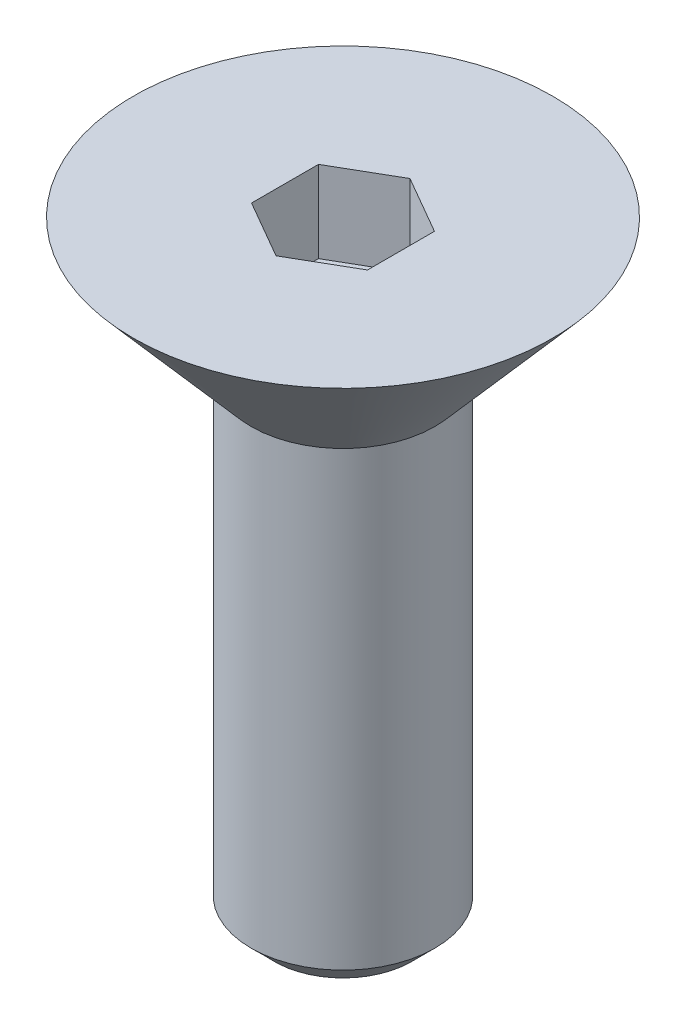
ISO-10303-21;
HEADER;
FILE_DESCRIPTION(('STEP AP214'),'2;1');
FILE_NAME('part.step','',(''),(''),'','','');
FILE_SCHEMA(('AUTOMOTIVE_DESIGN { 1 0 10303 214 1 1 1 1 }'));
ENDSEC;
DATA;
#1=APPLICATION_CONTEXT('core data for automotive mechanical design processes');
#2=APPLICATION_PROTOCOL_DEFINITION('international standard','automotive_design',2000,#1);
#3=PRODUCT_CONTEXT('',#1,'mechanical');
#4=PRODUCT('Part','Part','',(#3));
#5=PRODUCT_RELATED_PRODUCT_CATEGORY('part','',(#4));
#6=PRODUCT_DEFINITION_FORMATION('','',#4);
#7=PRODUCT_DEFINITION_CONTEXT('part definition',#1,'design');
#8=PRODUCT_DEFINITION('design','',#6,#7);
#9=PRODUCT_DEFINITION_SHAPE('','',#8);
#10=(LENGTH_UNIT() NAMED_UNIT(*) SI_UNIT(.MILLI.,.METRE.));
#11=(NAMED_UNIT(*) PLANE_ANGLE_UNIT() SI_UNIT($,.RADIAN.));
#12=(NAMED_UNIT(*) SI_UNIT($,.STERADIAN.) SOLID_ANGLE_UNIT());
#13=UNCERTAINTY_MEASURE_WITH_UNIT(LENGTH_MEASURE(1.E-05),#10,'distance_accuracy_value','');
#14=(GEOMETRIC_REPRESENTATION_CONTEXT(3) GLOBAL_UNCERTAINTY_ASSIGNED_CONTEXT((#13)) GLOBAL_UNIT_ASSIGNED_CONTEXT((#10,
#11,#12)) REPRESENTATION_CONTEXT('',''));
#15=CARTESIAN_POINT('',(0.,0.,0.));
#16=DIRECTION('',(0.,0.,1.));
#17=DIRECTION('',(1.,0.,0.));
#18=AXIS2_PLACEMENT_3D('',#15,#16,#17);
#19=CARTESIAN_POINT('',(0.,1.11022302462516E-13,0.));
#20=DIRECTION('',(0.,1.,0.));
#21=DIRECTION('',(0.,0.,1.00000000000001));
#22=AXIS2_PLACEMENT_3D('',#19,#20,#21);
#23=CONICAL_SURFACE('',#22,1.2573,0.715913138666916);
#24=CARTESIAN_POINT('',(0.,1.85420000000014,0.));
#25=DIRECTION('',(0.,-1.,0.));
#26=DIRECTION('',(0.,0.,-1.00000000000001));
#27=AXIS2_PLACEMENT_3D('',#24,#25,#26);
#28=CIRCLE('',#27,2.8702);
#29=CARTESIAN_POINT('',(0.,1.85420000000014,-2.87020000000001));
#30=VERTEX_POINT('',#29);
#31=EDGE_CURVE('E45',#30,#30,#28,.T.);
#32=ORIENTED_EDGE('',*,*,#31,.T.);
#33=EDGE_LOOP('',(#32));
#34=FACE_BOUND('',#33,.T.);
#35=CARTESIAN_POINT('',(0.,1.11022302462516E-13,0.));
#36=DIRECTION('',(0.,-1.,0.));
#37=DIRECTION('',(0.,0.,-1.00000000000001));
#38=AXIS2_PLACEMENT_3D('',#35,#36,#37);
#39=CIRCLE('',#38,1.2573);
#40=CARTESIAN_POINT('',(0.,1.11191369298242E-13,-1.25729999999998));
#41=VERTEX_POINT('',#40);
#42=EDGE_CURVE('E11',#41,#41,#39,.T.);
#43=ORIENTED_EDGE('',*,*,#42,.F.);
#44=EDGE_LOOP('',(#43));
#45=FACE_BOUND('',#44,.T.);
#46=ADVANCED_FACE('F38',(#34,#45),#23,.T.);
#47=CARTESIAN_POINT('',(2.87020000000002,1.85419999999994,0.));
#48=DIRECTION('',(0.,1.,0.));
#49=DIRECTION('',(0.,0.,1.00000000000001));
#50=AXIS2_PLACEMENT_3D('',#47,#48,#49);
#51=PLANE('',#50);
#52=DIRECTION('',(1.02066451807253E-11,0.,1.00000000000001));
#53=VECTOR('',#52,1.);
#54=CARTESIAN_POINT('',(-0.793750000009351,1.85420000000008,-0.458271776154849));
#55=LINE('',#54,#53);
#56=CARTESIAN_POINT('',(-0.793750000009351,1.85420000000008,-0.458271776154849));
#57=VERTEX_POINT('',#56);
#58=CARTESIAN_POINT('',(-0.793750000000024,1.85419999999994,0.458271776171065));
#59=VERTEX_POINT('',#58);
#60=EDGE_CURVE('E52',#57,#59,#55,.T.);
#61=ORIENTED_EDGE('',*,*,#60,.F.);
#62=DIRECTION('',(-0.866025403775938,0.,0.500000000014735));
#63=VECTOR('',#62,1.);
#64=CARTESIAN_POINT('',(-1.40165656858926E-11,1.85419999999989,-0.916543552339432));
#65=LINE('',#64,#63);
#66=CARTESIAN_POINT('',(-1.40165656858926E-11,1.85419999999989,-0.916543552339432));
#67=VERTEX_POINT('',#66);
#68=EDGE_CURVE('E122',#67,#57,#65,.T.);
#69=ORIENTED_EDGE('',*,*,#68,.F.);
#70=DIRECTION('',(-0.866025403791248,0.,-0.499999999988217));
#71=VECTOR('',#70,1.);
#72=CARTESIAN_POINT('',(0.793749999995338,1.85420000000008,-0.458271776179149));
#73=LINE('',#72,#71);
#74=CARTESIAN_POINT('',(0.793749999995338,1.85420000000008,-0.458271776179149));
#75=VERTEX_POINT('',#74);
#76=EDGE_CURVE('E116',#75,#67,#73,.T.);
#77=ORIENTED_EDGE('',*,*,#76,.F.);
#78=DIRECTION('',(-1.02064774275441E-11,0.,-1.00000000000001));
#79=VECTOR('',#78,1.);
#80=CARTESIAN_POINT('',(0.793750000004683,1.85419999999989,0.458271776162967));
#81=LINE('',#80,#79);
#82=CARTESIAN_POINT('',(0.793750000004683,1.85419999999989,0.458271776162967));
#83=VERTEX_POINT('',#82);
#84=EDGE_CURVE('E114',#83,#75,#81,.T.);
#85=ORIENTED_EDGE('',*,*,#84,.F.);
#86=DIRECTION('',(0.86602540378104,0.,-0.500000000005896));
#87=VECTOR('',#86,1.);
#88=CARTESIAN_POINT('',(4.69242700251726E-12,1.85420000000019,0.916543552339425));
#89=LINE('',#88,#87);
#90=CARTESIAN_POINT('',(4.69242700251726E-12,1.85420000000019,0.916543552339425));
#91=VERTEX_POINT('',#90);
#92=EDGE_CURVE('E95',#91,#83,#89,.T.);
#93=ORIENTED_EDGE('',*,*,#92,.F.);
#94=DIRECTION('',(0.866025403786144,0.,0.499999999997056));
#95=VECTOR('',#94,1.);
#96=CARTESIAN_POINT('',(-0.793750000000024,1.85419999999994,0.458271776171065));
#97=LINE('',#96,#95);
#98=EDGE_CURVE('E106',#59,#91,#97,.T.);
#99=ORIENTED_EDGE('',*,*,#98,.F.);
#100=EDGE_LOOP('',(#61,#69,#77,#85,#93,#99));
#101=FACE_BOUND('',#100,.T.);
#102=ORIENTED_EDGE('',*,*,#31,.F.);
#103=EDGE_LOOP('',(#102));
#104=FACE_BOUND('',#103,.T.);
#105=ADVANCED_FACE('F110',(#101,#104),#51,.T.);
#106=CARTESIAN_POINT('',(0.,-6.49999999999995,0.));
#107=DIRECTION('',(0.,-1.,0.));
#108=DIRECTION('',(0.,0.,-1.00000000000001));
#109=AXIS2_PLACEMENT_3D('',#106,#107,#108);
#110=PLANE('',#109);
#111=CARTESIAN_POINT('',(0.,-6.49999999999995,0.));
#112=DIRECTION('',(0.,-1.,0.));
#113=DIRECTION('',(0.,0.,-1.00000000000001));
#114=AXIS2_PLACEMENT_3D('',#111,#112,#113);
#115=CIRCLE('',#114,0.941070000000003);
#116=CARTESIAN_POINT('',(0.,-6.49999999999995,-0.941069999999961));
#117=VERTEX_POINT('',#116);
#118=EDGE_CURVE('E149',#117,#117,#115,.T.);
#119=ORIENTED_EDGE('',*,*,#118,.T.);
#120=EDGE_LOOP('',(#119));
#121=FACE_BOUND('',#120,.T.);
#122=ADVANCED_FACE('F156',(#121),#110,.T.);
#123=CARTESIAN_POINT('',(0.,-6.49999999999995,0.));
#124=DIRECTION('',(0.,1.,0.));
#125=DIRECTION('',(0.,0.,1.00000000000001));
#126=AXIS2_PLACEMENT_3D('',#123,#124,#125);
#127=CONICAL_SURFACE('',#126,0.941070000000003,0.785398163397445);
#128=CARTESIAN_POINT('',(0.,-6.18376999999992,0.));
#129=DIRECTION('',(0.,-1.,0.));
#130=DIRECTION('',(0.,0.,-1.00000000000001));
#131=AXIS2_PLACEMENT_3D('',#128,#129,#130);
#132=CIRCLE('',#131,1.2573);
#133=CARTESIAN_POINT('',(0.,-6.18376999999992,-1.25729999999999));
#134=VERTEX_POINT('',#133);
#135=EDGE_CURVE('E140',#134,#134,#132,.T.);
#136=ORIENTED_EDGE('',*,*,#135,.T.);
#137=EDGE_LOOP('',(#136));
#138=FACE_BOUND('',#137,.T.);
#139=ORIENTED_EDGE('',*,*,#118,.F.);
#140=EDGE_LOOP('',(#139));
#141=FACE_BOUND('',#140,.T.);
#142=ADVANCED_FACE('F161',(#138,#141),#127,.T.);
#143=CARTESIAN_POINT('',(0.,1.11022302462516E-13,0.));
#144=DIRECTION('',(0.,-1.,0.));
#145=DIRECTION('',(0.,0.,-1.00000000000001));
#146=AXIS2_PLACEMENT_3D('',#143,#144,#145);
#147=CYLINDRICAL_SURFACE('',#146,1.2573);
#148=ORIENTED_EDGE('',*,*,#42,.T.);
#149=EDGE_LOOP('',(#148));
#150=FACE_BOUND('',#149,.T.);
#151=ORIENTED_EDGE('',*,*,#135,.F.);
#152=EDGE_LOOP('',(#151));
#153=FACE_BOUND('',#152,.T.);
#154=ADVANCED_FACE('F167',(#150,#153),#147,.T.);
#155=CARTESIAN_POINT('',(-0.793750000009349,0.736600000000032,-0.458271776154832));
#156=DIRECTION('',(-1.00000000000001,0.,1.02067866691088E-11));
#157=DIRECTION('',(1.0206942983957E-11,0.,1.00000000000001));
#158=AXIS2_PLACEMENT_3D('',#155,#156,#157);
#159=PLANE('',#158);
#160=ORIENTED_EDGE('',*,*,#60,.T.);
#161=DIRECTION('',(0.,1.,0.));
#162=VECTOR('',#161,1.);
#163=CARTESIAN_POINT('',(-0.793750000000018,0.736599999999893,0.458271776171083));
#164=LINE('',#163,#162);
#165=CARTESIAN_POINT('',(-0.793750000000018,0.736599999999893,0.458271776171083));
#166=VERTEX_POINT('',#165);
#167=EDGE_CURVE('E103',#166,#59,#164,.T.);
#168=ORIENTED_EDGE('',*,*,#167,.F.);
#169=DIRECTION('',(1.02066451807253E-11,0.,1.00000000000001));
#170=VECTOR('',#169,1.);
#171=CARTESIAN_POINT('',(-0.793750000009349,0.736600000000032,-0.458271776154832));
#172=LINE('',#171,#170);
#173=CARTESIAN_POINT('',(-0.793750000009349,0.736600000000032,-0.458271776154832));
#174=VERTEX_POINT('',#173);
#175=EDGE_CURVE('E124',#174,#166,#172,.T.);
#176=ORIENTED_EDGE('',*,*,#175,.F.);
#177=DIRECTION('',(0.,1.,0.));
#178=VECTOR('',#177,1.);
#179=CARTESIAN_POINT('',(-0.793750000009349,0.736600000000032,-0.458271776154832));
#180=LINE('',#179,#178);
#181=EDGE_CURVE('E59',#174,#57,#180,.T.);
#182=ORIENTED_EDGE('',*,*,#181,.T.);
#183=EDGE_LOOP('',(#160,#168,#176,#182));
#184=FACE_BOUND('',#183,.T.);
#185=ADVANCED_FACE('F171',(#184),#159,.F.);
#186=CARTESIAN_POINT('',(-1.40165656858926E-11,0.736600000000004,-0.916543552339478));
#187=DIRECTION('',(-0.500000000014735,0.,-0.866025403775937));
#188=DIRECTION('',(-0.866025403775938,0.,0.500000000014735));
#189=AXIS2_PLACEMENT_3D('',#186,#187,#188);
#190=PLANE('',#189);
#191=ORIENTED_EDGE('',*,*,#68,.T.);
#192=ORIENTED_EDGE('',*,*,#181,.F.);
#193=DIRECTION('',(-0.866025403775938,0.,0.500000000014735));
#194=VECTOR('',#193,1.);
#195=CARTESIAN_POINT('',(-1.40165656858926E-11,0.736600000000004,-0.916543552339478));
#196=LINE('',#195,#194);
#197=CARTESIAN_POINT('',(-1.40165656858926E-11,0.736600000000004,-0.916543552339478));
#198=VERTEX_POINT('',#197);
#199=EDGE_CURVE('E136',#198,#174,#196,.T.);
#200=ORIENTED_EDGE('',*,*,#199,.F.);
#201=DIRECTION('',(0.,1.,0.));
#202=VECTOR('',#201,1.);
#203=CARTESIAN_POINT('',(-1.40165656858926E-11,0.736600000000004,-0.916543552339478));
#204=LINE('',#203,#202);
#205=EDGE_CURVE('E141',#198,#67,#204,.T.);
#206=ORIENTED_EDGE('',*,*,#205,.T.);
#207=EDGE_LOOP('',(#191,#192,#200,#206));
#208=FACE_BOUND('',#207,.T.);
#209=ADVANCED_FACE('F175',(#208),#190,.F.);
#210=CARTESIAN_POINT('',(0.79374999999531,0.736600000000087,-0.458271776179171));
#211=DIRECTION('',(0.499999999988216,0.,-0.866025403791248));
#212=DIRECTION('',(-0.866025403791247,0.,-0.499999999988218));
#213=AXIS2_PLACEMENT_3D('',#210,#211,#212);
#214=PLANE('',#213);
#215=ORIENTED_EDGE('',*,*,#76,.T.);
#216=ORIENTED_EDGE('',*,*,#205,.F.);
#217=DIRECTION('',(-0.866025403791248,0.,-0.499999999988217));
#218=VECTOR('',#217,1.);
#219=CARTESIAN_POINT('',(0.79374999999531,0.736600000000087,-0.458271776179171));
#220=LINE('',#219,#218);
#221=CARTESIAN_POINT('',(0.79374999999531,0.736600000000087,-0.458271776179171));
#222=VERTEX_POINT('',#221);
#223=EDGE_CURVE('E133',#222,#198,#220,.T.);
#224=ORIENTED_EDGE('',*,*,#223,.F.);
#225=DIRECTION('',(0.,1.,0.));
#226=VECTOR('',#225,1.);
#227=CARTESIAN_POINT('',(0.79374999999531,0.736600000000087,-0.458271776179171));
#228=LINE('',#227,#226);
#229=EDGE_CURVE('E143',#222,#75,#228,.T.);
#230=ORIENTED_EDGE('',*,*,#229,.T.);
#231=EDGE_LOOP('',(#215,#216,#224,#230));
#232=FACE_BOUND('',#231,.T.);
#233=ADVANCED_FACE('F184',(#232),#214,.F.);
#234=CARTESIAN_POINT('',(0.793750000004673,0.736599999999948,0.458271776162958));
#235=DIRECTION('',(1.00000000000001,0.,-1.02068277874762E-11));
#236=DIRECTION('',(-1.02064774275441E-11,0.,-1.00000000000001));
#237=AXIS2_PLACEMENT_3D('',#234,#235,#236);
#238=PLANE('',#237);
#239=ORIENTED_EDGE('',*,*,#84,.T.);
#240=ORIENTED_EDGE('',*,*,#229,.F.);
#241=DIRECTION('',(-1.02064774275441E-11,0.,-1.00000000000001));
#242=VECTOR('',#241,1.);
#243=CARTESIAN_POINT('',(0.793750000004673,0.736599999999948,0.458271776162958));
#244=LINE('',#243,#242);
#245=CARTESIAN_POINT('',(0.793750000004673,0.736599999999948,0.458271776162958));
#246=VERTEX_POINT('',#245);
#247=EDGE_CURVE('E130',#246,#222,#244,.T.);
#248=ORIENTED_EDGE('',*,*,#247,.F.);
#249=DIRECTION('',(0.,1.,0.));
#250=VECTOR('',#249,1.);
#251=CARTESIAN_POINT('',(0.793750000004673,0.736599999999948,0.458271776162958));
#252=LINE('',#251,#250);
#253=EDGE_CURVE('E102',#246,#83,#252,.T.);
#254=ORIENTED_EDGE('',*,*,#253,.T.);
#255=EDGE_LOOP('',(#239,#240,#248,#254));
#256=FACE_BOUND('',#255,.T.);
#257=ADVANCED_FACE('F181',(#256),#238,.F.);
#258=CARTESIAN_POINT('',(4.71671313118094E-12,0.736600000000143,0.91654355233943));
#259=DIRECTION('',(0.500000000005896,0.,0.866025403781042));
#260=DIRECTION('',(0.86602540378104,0.,-0.500000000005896));
#261=AXIS2_PLACEMENT_3D('',#258,#259,#260);
#262=PLANE('',#261);
#263=ORIENTED_EDGE('',*,*,#92,.T.);
#264=ORIENTED_EDGE('',*,*,#253,.F.);
#265=DIRECTION('',(0.86602540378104,0.,-0.500000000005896));
#266=VECTOR('',#265,1.);
#267=CARTESIAN_POINT('',(4.71671313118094E-12,0.736600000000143,0.91654355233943));
#268=LINE('',#267,#266);
#269=CARTESIAN_POINT('',(4.71671313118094E-12,0.736600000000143,0.91654355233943));
#270=VERTEX_POINT('',#269);
#271=EDGE_CURVE('E98',#270,#246,#268,.T.);
#272=ORIENTED_EDGE('',*,*,#271,.F.);
#273=DIRECTION('',(0.,1.,0.));
#274=VECTOR('',#273,1.);
#275=CARTESIAN_POINT('',(4.71671313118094E-12,0.736600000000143,0.91654355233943));
#276=LINE('',#275,#274);
#277=EDGE_CURVE('E91',#270,#91,#276,.T.);
#278=ORIENTED_EDGE('',*,*,#277,.T.);
#279=EDGE_LOOP('',(#263,#264,#272,#278));
#280=FACE_BOUND('',#279,.T.);
#281=ADVANCED_FACE('F93',(#280),#262,.F.);
#282=CARTESIAN_POINT('',(-0.793750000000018,0.736599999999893,0.458271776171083));
#283=DIRECTION('',(-0.499999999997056,0.,0.866025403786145));
#284=DIRECTION('',(0.866025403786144,0.,0.499999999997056));
#285=AXIS2_PLACEMENT_3D('',#282,#283,#284);
#286=PLANE('',#285);
#287=ORIENTED_EDGE('',*,*,#98,.T.);
#288=ORIENTED_EDGE('',*,*,#277,.F.);
#289=DIRECTION('',(0.866025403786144,0.,0.499999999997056));
#290=VECTOR('',#289,1.);
#291=CARTESIAN_POINT('',(-0.793750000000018,0.736599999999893,0.458271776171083));
#292=LINE('',#291,#290);
#293=EDGE_CURVE('E127',#166,#270,#292,.T.);
#294=ORIENTED_EDGE('',*,*,#293,.F.);
#295=ORIENTED_EDGE('',*,*,#167,.T.);
#296=EDGE_LOOP('',(#287,#288,#294,#295));
#297=FACE_BOUND('',#296,.T.);
#298=ADVANCED_FACE('F107',(#297),#286,.F.);
#299=CARTESIAN_POINT('',(-0.793749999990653,0.736600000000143,1.37481532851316));
#300=DIRECTION('',(0.,1.,0.));
#301=DIRECTION('',(0.,0.,1.00000000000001));
#302=AXIS2_PLACEMENT_3D('',#299,#300,#301);
#303=PLANE('',#302);
#304=ORIENTED_EDGE('',*,*,#175,.T.);
#305=ORIENTED_EDGE('',*,*,#293,.T.);
#306=ORIENTED_EDGE('',*,*,#271,.T.);
#307=ORIENTED_EDGE('',*,*,#247,.T.);
#308=ORIENTED_EDGE('',*,*,#223,.T.);
#309=ORIENTED_EDGE('',*,*,#199,.T.);
#310=EDGE_LOOP('',(#304,#305,#306,#307,#308,#309));
#311=FACE_BOUND('',#310,.T.);
#312=ADVANCED_FACE('F178',(#311),#303,.T.);
#313=CLOSED_SHELL('',(#46,#105,#122,#142,#154,#185,#209,#233,#257,#281,#298,#312));
#314=MANIFOLD_SOLID_BREP('B2',#313);
#315=ADVANCED_BREP_SHAPE_REPRESENTATION('',(#18,#314),#14);
#316=SHAPE_DEFINITION_REPRESENTATION(#9,#315);
ENDSEC;
END-ISO-10303-21;
